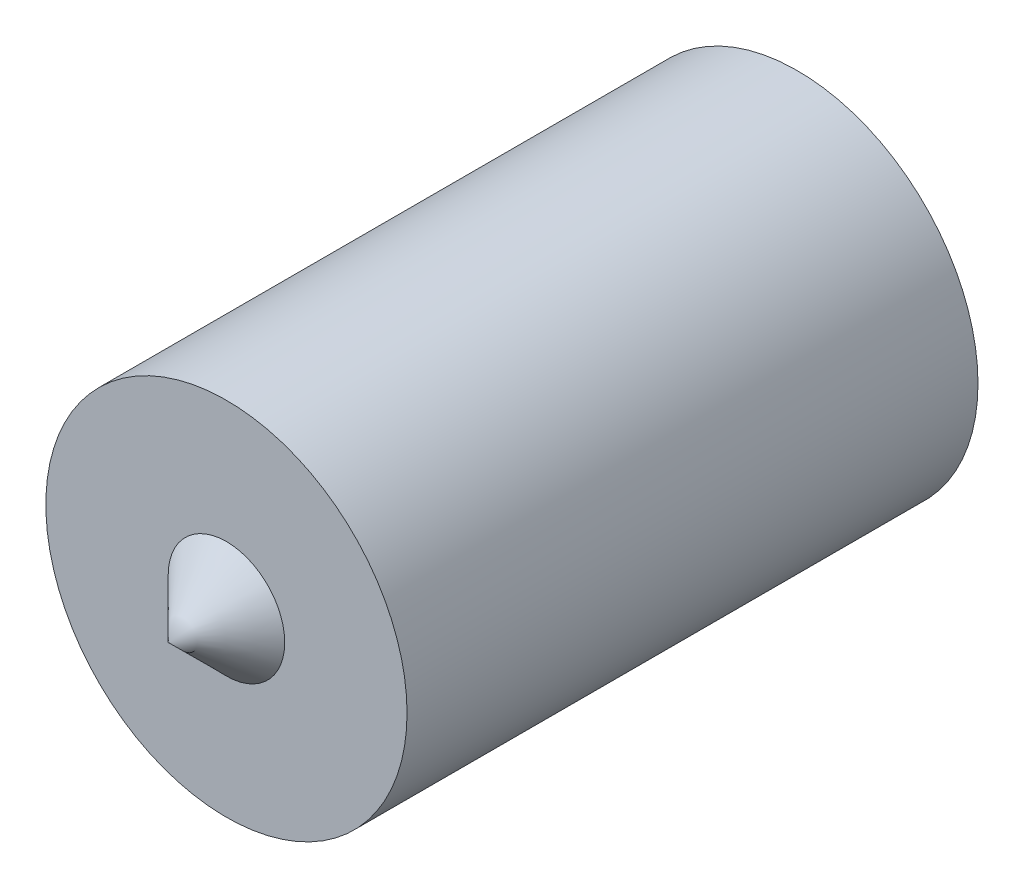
from build123d import *


with BuildPart() as part:
    # Sketch 1 → Revolve 1 (revolve)
    with BuildSketch(Plane(origin=(0, 0, 0), x_dir=(0, 0, -1), z_dir=(1, 0, 0)), mode=Mode.PRIVATE) as revolve_1_sk:
        Polygon((0, 0), (1.115456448, 0), (2.032, 1.5875), (6.858, 1.5875), (6.858, 1.9685), (0.635, 1.9685), (0.635, 0.635), align=None)
    revolve(revolve_1_sk.sketch.rotate(Axis((0, 0, 0), (0, 0, -1)), 270), axis=Axis((0, 0, 0), (0, 0, -1)))


solid = part.part
